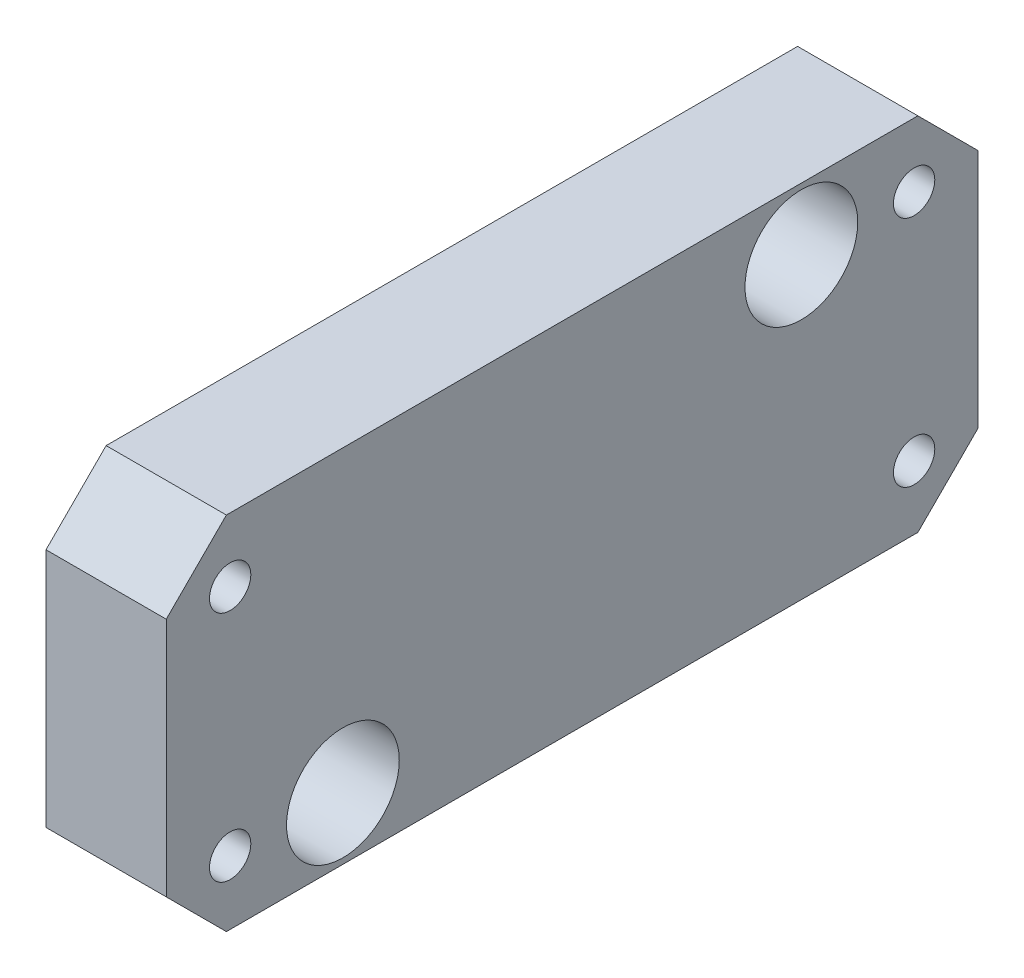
ISO-10303-21;
HEADER;
FILE_DESCRIPTION(('STEP AP214'),'2;1');
FILE_NAME('part.step','',(''),(''),'','','');
FILE_SCHEMA(('AUTOMOTIVE_DESIGN { 1 0 10303 214 1 1 1 1 }'));
ENDSEC;
DATA;
#1=APPLICATION_CONTEXT('core data for automotive mechanical design processes');
#2=APPLICATION_PROTOCOL_DEFINITION('international standard','automotive_design',2000,#1);
#3=PRODUCT_CONTEXT('',#1,'mechanical');
#4=PRODUCT('Part','Part','',(#3));
#5=PRODUCT_RELATED_PRODUCT_CATEGORY('part','',(#4));
#6=PRODUCT_DEFINITION_FORMATION('','',#4);
#7=PRODUCT_DEFINITION_CONTEXT('part definition',#1,'design');
#8=PRODUCT_DEFINITION('design','',#6,#7);
#9=PRODUCT_DEFINITION_SHAPE('','',#8);
#10=(LENGTH_UNIT() NAMED_UNIT(*) SI_UNIT(.MILLI.,.METRE.));
#11=(NAMED_UNIT(*) PLANE_ANGLE_UNIT() SI_UNIT($,.RADIAN.));
#12=(NAMED_UNIT(*) SI_UNIT($,.STERADIAN.) SOLID_ANGLE_UNIT());
#13=UNCERTAINTY_MEASURE_WITH_UNIT(LENGTH_MEASURE(1.E-05),#10,'distance_accuracy_value','');
#14=(GEOMETRIC_REPRESENTATION_CONTEXT(3) GLOBAL_UNCERTAINTY_ASSIGNED_CONTEXT((#13)) GLOBAL_UNIT_ASSIGNED_CONTEXT((#10,
#11,#12)) REPRESENTATION_CONTEXT('',''));
#15=CARTESIAN_POINT('',(0.,0.,0.));
#16=DIRECTION('',(0.,0.,1.));
#17=DIRECTION('',(1.,0.,0.));
#18=AXIS2_PLACEMENT_3D('',#15,#16,#17);
#19=CARTESIAN_POINT('',(-44.,0.,0.));
#20=DIRECTION('',(1.,0.,0.));
#21=DIRECTION('',(0.,0.,-1.));
#22=AXIS2_PLACEMENT_3D('',#19,#20,#21);
#23=PLANE('',#22);
#24=DIRECTION('',(0.,0.707106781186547,0.707106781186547));
#25=VECTOR('',#24,1.);
#26=CARTESIAN_POINT('',(-44.,-24.,46.));
#27=LINE('',#26,#25);
#28=CARTESIAN_POINT('',(-44.,-24.,46.));
#29=VERTEX_POINT('',#28);
#30=CARTESIAN_POINT('',(-44.,-16.,54.));
#31=VERTEX_POINT('',#30);
#32=EDGE_CURVE('E78',#29,#31,#27,.T.);
#33=ORIENTED_EDGE('',*,*,#32,.F.);
#34=DIRECTION('',(0.,0.,1.));
#35=VECTOR('',#34,1.);
#36=CARTESIAN_POINT('',(-44.,-24.,-46.));
#37=LINE('',#36,#35);
#38=CARTESIAN_POINT('',(-44.,-24.,-46.));
#39=VERTEX_POINT('',#38);
#40=EDGE_CURVE('E254',#39,#29,#37,.T.);
#41=ORIENTED_EDGE('',*,*,#40,.F.);
#42=DIRECTION('',(0.,-0.707106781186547,0.707106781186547));
#43=VECTOR('',#42,1.);
#44=CARTESIAN_POINT('',(-44.,-16.,-54.));
#45=LINE('',#44,#43);
#46=CARTESIAN_POINT('',(-44.,-16.,-54.));
#47=VERTEX_POINT('',#46);
#48=EDGE_CURVE('E255',#47,#39,#45,.T.);
#49=ORIENTED_EDGE('',*,*,#48,.F.);
#50=DIRECTION('',(0.,-1.,0.));
#51=VECTOR('',#50,1.);
#52=CARTESIAN_POINT('',(-44.,16.,-54.));
#53=LINE('',#52,#51);
#54=CARTESIAN_POINT('',(-44.,16.,-54.));
#55=VERTEX_POINT('',#54);
#56=EDGE_CURVE('E215',#55,#47,#53,.T.);
#57=ORIENTED_EDGE('',*,*,#56,.F.);
#58=DIRECTION('',(0.,-0.707106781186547,-0.707106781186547));
#59=VECTOR('',#58,1.);
#60=CARTESIAN_POINT('',(-44.,24.,-46.));
#61=LINE('',#60,#59);
#62=CARTESIAN_POINT('',(-44.,24.,-46.));
#63=VERTEX_POINT('',#62);
#64=EDGE_CURVE('E216',#63,#55,#61,.T.);
#65=ORIENTED_EDGE('',*,*,#64,.F.);
#66=DIRECTION('',(0.,0.,-1.));
#67=VECTOR('',#66,1.);
#68=CARTESIAN_POINT('',(-44.,24.,46.));
#69=LINE('',#68,#67);
#70=CARTESIAN_POINT('',(-44.,24.,46.));
#71=VERTEX_POINT('',#70);
#72=EDGE_CURVE('E188',#71,#63,#69,.T.);
#73=ORIENTED_EDGE('',*,*,#72,.F.);
#74=DIRECTION('',(0.,0.707106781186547,-0.707106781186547));
#75=VECTOR('',#74,1.);
#76=CARTESIAN_POINT('',(-44.,16.,54.));
#77=LINE('',#76,#75);
#78=CARTESIAN_POINT('',(-44.,16.,54.));
#79=VERTEX_POINT('',#78);
#80=EDGE_CURVE('E156',#79,#71,#77,.T.);
#81=ORIENTED_EDGE('',*,*,#80,.F.);
#82=DIRECTION('',(0.,1.,0.));
#83=VECTOR('',#82,1.);
#84=CARTESIAN_POINT('',(-44.,-16.,54.));
#85=LINE('',#84,#83);
#86=EDGE_CURVE('E86',#31,#79,#85,.T.);
#87=ORIENTED_EDGE('',*,*,#86,.F.);
#88=EDGE_LOOP('',(#33,#41,#49,#57,#65,#73,#81,#87));
#89=FACE_BOUND('',#88,.T.);
#90=CARTESIAN_POINT('',(-44.,-15.75,30.5));
#91=DIRECTION('',(-1.,0.,0.));
#92=DIRECTION('',(0.,0.,-1.));
#93=AXIS2_PLACEMENT_3D('',#90,#91,#92);
#94=CIRCLE('',#93,7.5);
#95=CARTESIAN_POINT('',(-44.,-15.75,23.));
#96=VERTEX_POINT('',#95);
#97=EDGE_CURVE('E9',#96,#96,#94,.T.);
#98=ORIENTED_EDGE('',*,*,#97,.T.);
#99=EDGE_LOOP('',(#98));
#100=FACE_BOUND('',#99,.T.);
#101=CARTESIAN_POINT('',(-44.,15.75,-30.5));
#102=DIRECTION('',(-1.,0.,0.));
#103=DIRECTION('',(0.,0.,-1.));
#104=AXIS2_PLACEMENT_3D('',#101,#102,#103);
#105=CIRCLE('',#104,7.5);
#106=CARTESIAN_POINT('',(-44.,15.75,-38.));
#107=VERTEX_POINT('',#106);
#108=EDGE_CURVE('E25',#107,#107,#105,.T.);
#109=ORIENTED_EDGE('',*,*,#108,.T.);
#110=EDGE_LOOP('',(#109));
#111=FACE_BOUND('',#110,.T.);
#112=CARTESIAN_POINT('',(-44.,-15.5,45.5));
#113=DIRECTION('',(-1.,0.,0.));
#114=DIRECTION('',(0.,0.,-1.));
#115=AXIS2_PLACEMENT_3D('',#112,#113,#114);
#116=CIRCLE('',#115,2.75);
#117=CARTESIAN_POINT('',(-44.,-15.5,42.75));
#118=VERTEX_POINT('',#117);
#119=EDGE_CURVE('E155',#118,#118,#116,.T.);
#120=ORIENTED_EDGE('',*,*,#119,.T.);
#121=EDGE_LOOP('',(#120));
#122=FACE_BOUND('',#121,.T.);
#123=CARTESIAN_POINT('',(-44.,15.5,45.5));
#124=DIRECTION('',(-1.,0.,0.));
#125=DIRECTION('',(0.,0.,-1.));
#126=AXIS2_PLACEMENT_3D('',#123,#124,#125);
#127=CIRCLE('',#126,2.75);
#128=CARTESIAN_POINT('',(-44.,15.5,42.75));
#129=VERTEX_POINT('',#128);
#130=EDGE_CURVE('E150',#129,#129,#127,.T.);
#131=ORIENTED_EDGE('',*,*,#130,.T.);
#132=EDGE_LOOP('',(#131));
#133=FACE_BOUND('',#132,.T.);
#134=CARTESIAN_POINT('',(-44.,15.5,-45.5));
#135=DIRECTION('',(-1.,0.,0.));
#136=DIRECTION('',(0.,0.,-1.));
#137=AXIS2_PLACEMENT_3D('',#134,#135,#136);
#138=CIRCLE('',#137,2.75);
#139=CARTESIAN_POINT('',(-44.,15.5,-48.25));
#140=VERTEX_POINT('',#139);
#141=EDGE_CURVE('E146',#140,#140,#138,.T.);
#142=ORIENTED_EDGE('',*,*,#141,.T.);
#143=EDGE_LOOP('',(#142));
#144=FACE_BOUND('',#143,.T.);
#145=CARTESIAN_POINT('',(-44.,-15.5,-45.5));
#146=DIRECTION('',(-1.,0.,0.));
#147=DIRECTION('',(0.,0.,-1.));
#148=AXIS2_PLACEMENT_3D('',#145,#146,#147);
#149=CIRCLE('',#148,2.75);
#150=CARTESIAN_POINT('',(-44.,-15.5,-48.25));
#151=VERTEX_POINT('',#150);
#152=EDGE_CURVE('E151',#151,#151,#149,.T.);
#153=ORIENTED_EDGE('',*,*,#152,.T.);
#154=EDGE_LOOP('',(#153));
#155=FACE_BOUND('',#154,.T.);
#156=ADVANCED_FACE('F14',(#89,#100,#111,#122,#133,#144,#155),#23,.T.);
#157=CARTESIAN_POINT('',(-60.0000000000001,0.,0.));
#158=DIRECTION('',(-1.,0.,0.));
#159=DIRECTION('',(0.,0.,1.));
#160=AXIS2_PLACEMENT_3D('',#157,#158,#159);
#161=PLANE('',#160);
#162=DIRECTION('',(0.,0.,1.));
#163=VECTOR('',#162,1.);
#164=CARTESIAN_POINT('',(-60.0000000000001,-24.,-46.));
#165=LINE('',#164,#163);
#166=CARTESIAN_POINT('',(-60.0000000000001,-24.,-46.));
#167=VERTEX_POINT('',#166);
#168=CARTESIAN_POINT('',(-60.0000000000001,-24.,46.));
#169=VERTEX_POINT('',#168);
#170=EDGE_CURVE('E207',#167,#169,#165,.T.);
#171=ORIENTED_EDGE('',*,*,#170,.T.);
#172=DIRECTION('',(0.,0.707106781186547,0.707106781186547));
#173=VECTOR('',#172,1.);
#174=CARTESIAN_POINT('',(-60.0000000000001,-24.,46.));
#175=LINE('',#174,#173);
#176=CARTESIAN_POINT('',(-60.0000000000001,-16.,54.));
#177=VERTEX_POINT('',#176);
#178=EDGE_CURVE('E211',#169,#177,#175,.T.);
#179=ORIENTED_EDGE('',*,*,#178,.T.);
#180=DIRECTION('',(0.,1.,0.));
#181=VECTOR('',#180,1.);
#182=CARTESIAN_POINT('',(-60.0000000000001,-16.,54.));
#183=LINE('',#182,#181);
#184=CARTESIAN_POINT('',(-60.0000000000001,16.,54.));
#185=VERTEX_POINT('',#184);
#186=EDGE_CURVE('E220',#177,#185,#183,.T.);
#187=ORIENTED_EDGE('',*,*,#186,.T.);
#188=DIRECTION('',(0.,0.707106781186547,-0.707106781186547));
#189=VECTOR('',#188,1.);
#190=CARTESIAN_POINT('',(-60.0000000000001,16.,54.));
#191=LINE('',#190,#189);
#192=CARTESIAN_POINT('',(-60.0000000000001,24.,46.));
#193=VERTEX_POINT('',#192);
#194=EDGE_CURVE('E217',#185,#193,#191,.T.);
#195=ORIENTED_EDGE('',*,*,#194,.T.);
#196=DIRECTION('',(0.,0.,-1.));
#197=VECTOR('',#196,1.);
#198=CARTESIAN_POINT('',(-60.0000000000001,24.,46.));
#199=LINE('',#198,#197);
#200=CARTESIAN_POINT('',(-60.0000000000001,24.,-46.));
#201=VERTEX_POINT('',#200);
#202=EDGE_CURVE('E221',#193,#201,#199,.T.);
#203=ORIENTED_EDGE('',*,*,#202,.T.);
#204=DIRECTION('',(0.,-0.707106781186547,-0.707106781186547));
#205=VECTOR('',#204,1.);
#206=CARTESIAN_POINT('',(-60.0000000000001,24.,-46.));
#207=LINE('',#206,#205);
#208=CARTESIAN_POINT('',(-60.0000000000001,16.,-54.));
#209=VERTEX_POINT('',#208);
#210=EDGE_CURVE('E243',#201,#209,#207,.T.);
#211=ORIENTED_EDGE('',*,*,#210,.T.);
#212=DIRECTION('',(0.,-1.,0.));
#213=VECTOR('',#212,1.);
#214=CARTESIAN_POINT('',(-60.0000000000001,16.,-54.));
#215=LINE('',#214,#213);
#216=CARTESIAN_POINT('',(-60.0000000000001,-16.,-54.));
#217=VERTEX_POINT('',#216);
#218=EDGE_CURVE('E258',#209,#217,#215,.T.);
#219=ORIENTED_EDGE('',*,*,#218,.T.);
#220=DIRECTION('',(0.,-0.707106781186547,0.707106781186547));
#221=VECTOR('',#220,1.);
#222=CARTESIAN_POINT('',(-60.0000000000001,-16.,-54.));
#223=LINE('',#222,#221);
#224=EDGE_CURVE('E262',#217,#167,#223,.T.);
#225=ORIENTED_EDGE('',*,*,#224,.T.);
#226=EDGE_LOOP('',(#171,#179,#187,#195,#203,#211,#219,#225));
#227=FACE_BOUND('',#226,.T.);
#228=CARTESIAN_POINT('',(-60.0000000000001,-15.75,30.5));
#229=DIRECTION('',(1.,0.,0.));
#230=DIRECTION('',(0.,0.,-1.));
#231=AXIS2_PLACEMENT_3D('',#228,#229,#230);
#232=CIRCLE('',#231,7.5);
#233=CARTESIAN_POINT('',(-60.0000000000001,-15.75,23.));
#234=VERTEX_POINT('',#233);
#235=EDGE_CURVE('E231',#234,#234,#232,.T.);
#236=ORIENTED_EDGE('',*,*,#235,.T.);
#237=EDGE_LOOP('',(#236));
#238=FACE_BOUND('',#237,.T.);
#239=CARTESIAN_POINT('',(-60.0000000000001,15.75,-30.5));
#240=DIRECTION('',(1.,0.,0.));
#241=DIRECTION('',(0.,0.,-1.));
#242=AXIS2_PLACEMENT_3D('',#239,#240,#241);
#243=CIRCLE('',#242,7.5);
#244=CARTESIAN_POINT('',(-60.0000000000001,15.75,-38.));
#245=VERTEX_POINT('',#244);
#246=EDGE_CURVE('E227',#245,#245,#243,.T.);
#247=ORIENTED_EDGE('',*,*,#246,.T.);
#248=EDGE_LOOP('',(#247));
#249=FACE_BOUND('',#248,.T.);
#250=CARTESIAN_POINT('',(-60.0000000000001,0.,0.));
#251=DIRECTION('',(1.,0.,0.));
#252=DIRECTION('',(0.,0.,-1.));
#253=AXIS2_PLACEMENT_3D('',#250,#251,#252);
#254=CIRCLE('',#253,6.);
#255=CARTESIAN_POINT('',(-60.0000000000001,0.,-6.));
#256=VERTEX_POINT('',#255);
#257=EDGE_CURVE('E232',#256,#256,#254,.T.);
#258=ORIENTED_EDGE('',*,*,#257,.T.);
#259=EDGE_LOOP('',(#258));
#260=FACE_BOUND('',#259,.T.);
#261=CARTESIAN_POINT('',(-60.0000000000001,-15.5,45.5));
#262=DIRECTION('',(1.,0.,0.));
#263=DIRECTION('',(0.,0.,-1.));
#264=AXIS2_PLACEMENT_3D('',#261,#262,#263);
#265=CIRCLE('',#264,5.);
#266=CARTESIAN_POINT('',(-60.0000000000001,-15.5,40.5));
#267=VERTEX_POINT('',#266);
#268=EDGE_CURVE('E276',#267,#267,#265,.T.);
#269=ORIENTED_EDGE('',*,*,#268,.T.);
#270=EDGE_LOOP('',(#269));
#271=FACE_BOUND('',#270,.T.);
#272=CARTESIAN_POINT('',(-60.0000000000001,15.5,45.5));
#273=DIRECTION('',(1.,0.,0.));
#274=DIRECTION('',(0.,0.,-1.));
#275=AXIS2_PLACEMENT_3D('',#272,#273,#274);
#276=CIRCLE('',#275,5.);
#277=CARTESIAN_POINT('',(-60.0000000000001,15.5,40.5));
#278=VERTEX_POINT('',#277);
#279=EDGE_CURVE('E272',#278,#278,#276,.T.);
#280=ORIENTED_EDGE('',*,*,#279,.T.);
#281=EDGE_LOOP('',(#280));
#282=FACE_BOUND('',#281,.T.);
#283=CARTESIAN_POINT('',(-60.0000000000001,15.5,-45.5));
#284=DIRECTION('',(1.,0.,0.));
#285=DIRECTION('',(0.,0.,-1.));
#286=AXIS2_PLACEMENT_3D('',#283,#284,#285);
#287=CIRCLE('',#286,5.);
#288=CARTESIAN_POINT('',(-60.0000000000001,15.5,-50.5));
#289=VERTEX_POINT('',#288);
#290=EDGE_CURVE('E277',#289,#289,#287,.T.);
#291=ORIENTED_EDGE('',*,*,#290,.T.);
#292=EDGE_LOOP('',(#291));
#293=FACE_BOUND('',#292,.T.);
#294=CARTESIAN_POINT('',(-60.0000000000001,-15.5,-45.5));
#295=DIRECTION('',(1.,0.,0.));
#296=DIRECTION('',(0.,0.,-1.));
#297=AXIS2_PLACEMENT_3D('',#294,#295,#296);
#298=CIRCLE('',#297,5.);
#299=CARTESIAN_POINT('',(-60.0000000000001,-15.5,-50.5));
#300=VERTEX_POINT('',#299);
#301=EDGE_CURVE('E280',#300,#300,#298,.T.);
#302=ORIENTED_EDGE('',*,*,#301,.T.);
#303=EDGE_LOOP('',(#302));
#304=FACE_BOUND('',#303,.T.);
#305=ADVANCED_FACE('F373',(#227,#238,#249,#260,#271,#282,#293,#304),#161,.T.);
#306=CARTESIAN_POINT('',(-60.0000000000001,-24.,-46.));
#307=DIRECTION('',(0.,-1.,0.));
#308=DIRECTION('',(0.,0.,-1.));
#309=AXIS2_PLACEMENT_3D('',#306,#307,#308);
#310=PLANE('',#309);
#311=ORIENTED_EDGE('',*,*,#40,.T.);
#312=DIRECTION('',(1.,0.,0.));
#313=VECTOR('',#312,1.);
#314=CARTESIAN_POINT('',(-60.0000000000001,-24.,46.));
#315=LINE('',#314,#313);
#316=EDGE_CURVE('E34',#169,#29,#315,.T.);
#317=ORIENTED_EDGE('',*,*,#316,.F.);
#318=ORIENTED_EDGE('',*,*,#170,.F.);
#319=DIRECTION('',(1.,0.,0.));
#320=VECTOR('',#319,1.);
#321=CARTESIAN_POINT('',(-60.0000000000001,-24.,-46.));
#322=LINE('',#321,#320);
#323=EDGE_CURVE('E250',#167,#39,#322,.T.);
#324=ORIENTED_EDGE('',*,*,#323,.T.);
#325=EDGE_LOOP('',(#311,#317,#318,#324));
#326=FACE_BOUND('',#325,.T.);
#327=ADVANCED_FACE('F378',(#326),#310,.T.);
#328=CARTESIAN_POINT('',(-60.0000000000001,-16.,-54.));
#329=DIRECTION('',(0.,-0.707106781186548,-0.707106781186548));
#330=DIRECTION('',(0.,0.707106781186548,-0.707106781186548));
#331=AXIS2_PLACEMENT_3D('',#328,#329,#330);
#332=PLANE('',#331);
#333=ORIENTED_EDGE('',*,*,#48,.T.);
#334=ORIENTED_EDGE('',*,*,#323,.F.);
#335=ORIENTED_EDGE('',*,*,#224,.F.);
#336=DIRECTION('',(1.,0.,0.));
#337=VECTOR('',#336,1.);
#338=CARTESIAN_POINT('',(-60.0000000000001,-16.,-54.));
#339=LINE('',#338,#337);
#340=EDGE_CURVE('E226',#217,#47,#339,.T.);
#341=ORIENTED_EDGE('',*,*,#340,.T.);
#342=EDGE_LOOP('',(#333,#334,#335,#341));
#343=FACE_BOUND('',#342,.T.);
#344=ADVANCED_FACE('F385',(#343),#332,.T.);
#345=CARTESIAN_POINT('',(-60.0000000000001,16.,-54.));
#346=DIRECTION('',(0.,0.,-1.));
#347=DIRECTION('',(-1.,0.,0.));
#348=AXIS2_PLACEMENT_3D('',#345,#346,#347);
#349=PLANE('',#348);
#350=ORIENTED_EDGE('',*,*,#56,.T.);
#351=ORIENTED_EDGE('',*,*,#340,.F.);
#352=ORIENTED_EDGE('',*,*,#218,.F.);
#353=DIRECTION('',(1.,0.,0.));
#354=VECTOR('',#353,1.);
#355=CARTESIAN_POINT('',(-60.0000000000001,16.,-54.));
#356=LINE('',#355,#354);
#357=EDGE_CURVE('E212',#209,#55,#356,.T.);
#358=ORIENTED_EDGE('',*,*,#357,.T.);
#359=EDGE_LOOP('',(#350,#351,#352,#358));
#360=FACE_BOUND('',#359,.T.);
#361=ADVANCED_FACE('F389',(#360),#349,.T.);
#362=CARTESIAN_POINT('',(-60.0000000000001,24.,-46.));
#363=DIRECTION('',(0.,0.707106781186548,-0.707106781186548));
#364=DIRECTION('',(0.,0.707106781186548,0.707106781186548));
#365=AXIS2_PLACEMENT_3D('',#362,#363,#364);
#366=PLANE('',#365);
#367=ORIENTED_EDGE('',*,*,#64,.T.);
#368=ORIENTED_EDGE('',*,*,#357,.F.);
#369=ORIENTED_EDGE('',*,*,#210,.F.);
#370=DIRECTION('',(1.,0.,0.));
#371=VECTOR('',#370,1.);
#372=CARTESIAN_POINT('',(-60.0000000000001,24.,-46.));
#373=LINE('',#372,#371);
#374=EDGE_CURVE('E239',#201,#63,#373,.T.);
#375=ORIENTED_EDGE('',*,*,#374,.T.);
#376=EDGE_LOOP('',(#367,#368,#369,#375));
#377=FACE_BOUND('',#376,.T.);
#378=ADVANCED_FACE('F393',(#377),#366,.T.);
#379=CARTESIAN_POINT('',(-60.0000000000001,24.,46.));
#380=DIRECTION('',(0.,1.,0.));
#381=DIRECTION('',(0.,0.,1.));
#382=AXIS2_PLACEMENT_3D('',#379,#380,#381);
#383=PLANE('',#382);
#384=ORIENTED_EDGE('',*,*,#72,.T.);
#385=ORIENTED_EDGE('',*,*,#374,.F.);
#386=ORIENTED_EDGE('',*,*,#202,.F.);
#387=DIRECTION('',(1.,0.,0.));
#388=VECTOR('',#387,1.);
#389=CARTESIAN_POINT('',(-60.0000000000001,24.,46.));
#390=LINE('',#389,#388);
#391=EDGE_CURVE('E159',#193,#71,#390,.T.);
#392=ORIENTED_EDGE('',*,*,#391,.T.);
#393=EDGE_LOOP('',(#384,#385,#386,#392));
#394=FACE_BOUND('',#393,.T.);
#395=ADVANCED_FACE('F397',(#394),#383,.T.);
#396=CARTESIAN_POINT('',(-60.0000000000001,16.,54.));
#397=DIRECTION('',(0.,0.707106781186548,0.707106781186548));
#398=DIRECTION('',(0.,-0.707106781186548,0.707106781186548));
#399=AXIS2_PLACEMENT_3D('',#396,#397,#398);
#400=PLANE('',#399);
#401=ORIENTED_EDGE('',*,*,#80,.T.);
#402=ORIENTED_EDGE('',*,*,#391,.F.);
#403=ORIENTED_EDGE('',*,*,#194,.F.);
#404=DIRECTION('',(1.,0.,0.));
#405=VECTOR('',#404,1.);
#406=CARTESIAN_POINT('',(-60.0000000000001,16.,54.));
#407=LINE('',#406,#405);
#408=EDGE_CURVE('E160',#185,#79,#407,.T.);
#409=ORIENTED_EDGE('',*,*,#408,.T.);
#410=EDGE_LOOP('',(#401,#402,#403,#409));
#411=FACE_BOUND('',#410,.T.);
#412=ADVANCED_FACE('F401',(#411),#400,.T.);
#413=CARTESIAN_POINT('',(-60.0000000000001,-16.,54.));
#414=DIRECTION('',(0.,0.,1.));
#415=DIRECTION('',(1.,0.,0.));
#416=AXIS2_PLACEMENT_3D('',#413,#414,#415);
#417=PLANE('',#416);
#418=ORIENTED_EDGE('',*,*,#86,.T.);
#419=ORIENTED_EDGE('',*,*,#408,.F.);
#420=ORIENTED_EDGE('',*,*,#186,.F.);
#421=DIRECTION('',(1.,0.,0.));
#422=VECTOR('',#421,1.);
#423=CARTESIAN_POINT('',(-60.0000000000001,-16.,54.));
#424=LINE('',#423,#422);
#425=EDGE_CURVE('E286',#177,#31,#424,.T.);
#426=ORIENTED_EDGE('',*,*,#425,.T.);
#427=EDGE_LOOP('',(#418,#419,#420,#426));
#428=FACE_BOUND('',#427,.T.);
#429=ADVANCED_FACE('F405',(#428),#417,.T.);
#430=CARTESIAN_POINT('',(-60.0000000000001,-24.,46.));
#431=DIRECTION('',(0.,-0.707106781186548,0.707106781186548));
#432=DIRECTION('',(0.,-0.707106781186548,-0.707106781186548));
#433=AXIS2_PLACEMENT_3D('',#430,#431,#432);
#434=PLANE('',#433);
#435=ORIENTED_EDGE('',*,*,#32,.T.);
#436=ORIENTED_EDGE('',*,*,#425,.F.);
#437=ORIENTED_EDGE('',*,*,#178,.F.);
#438=ORIENTED_EDGE('',*,*,#316,.T.);
#439=EDGE_LOOP('',(#435,#436,#437,#438));
#440=FACE_BOUND('',#439,.T.);
#441=ADVANCED_FACE('F409',(#440),#434,.T.);
#442=CARTESIAN_POINT('',(-52.,-15.75,30.5));
#443=DIRECTION('',(-1.,0.,0.));
#444=DIRECTION('',(0.,0.,1.));
#445=AXIS2_PLACEMENT_3D('',#442,#443,#444);
#446=CYLINDRICAL_SURFACE('',#445,7.5);
#447=ORIENTED_EDGE('',*,*,#97,.F.);
#448=EDGE_LOOP('',(#447));
#449=FACE_BOUND('',#448,.T.);
#450=ORIENTED_EDGE('',*,*,#235,.F.);
#451=EDGE_LOOP('',(#450));
#452=FACE_BOUND('',#451,.T.);
#453=ADVANCED_FACE('F412',(#449,#452),#446,.F.);
#454=CARTESIAN_POINT('',(-52.,15.75,-30.5));
#455=DIRECTION('',(-1.,0.,0.));
#456=DIRECTION('',(0.,0.,1.));
#457=AXIS2_PLACEMENT_3D('',#454,#455,#456);
#458=CYLINDRICAL_SURFACE('',#457,7.5);
#459=ORIENTED_EDGE('',*,*,#108,.F.);
#460=EDGE_LOOP('',(#459));
#461=FACE_BOUND('',#460,.T.);
#462=ORIENTED_EDGE('',*,*,#246,.F.);
#463=EDGE_LOOP('',(#462));
#464=FACE_BOUND('',#463,.T.);
#465=ADVANCED_FACE('F417',(#461,#464),#458,.F.);
#466=CARTESIAN_POINT('',(-46.,0.,0.));
#467=DIRECTION('',(-1.,0.,0.));
#468=DIRECTION('',(0.,0.,1.));
#469=AXIS2_PLACEMENT_3D('',#466,#467,#468);
#470=PLANE('',#469);
#471=CARTESIAN_POINT('',(-46.,0.,0.));
#472=DIRECTION('',(1.,0.,0.));
#473=DIRECTION('',(0.,0.,-1.));
#474=AXIS2_PLACEMENT_3D('',#471,#472,#473);
#475=CIRCLE('',#474,3.375);
#476=CARTESIAN_POINT('',(-46.,0.,-3.375));
#477=VERTEX_POINT('',#476);
#478=EDGE_CURVE('E189',#477,#477,#475,.T.);
#479=ORIENTED_EDGE('',*,*,#478,.F.);
#480=EDGE_LOOP('',(#479));
#481=FACE_BOUND('',#480,.T.);
#482=ADVANCED_FACE('F413',(#481),#470,.T.);
#483=CARTESIAN_POINT('',(-52.9999999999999,0.,0.));
#484=DIRECTION('',(-1.,0.,0.));
#485=DIRECTION('',(0.,0.,1.));
#486=AXIS2_PLACEMENT_3D('',#483,#484,#485);
#487=CYLINDRICAL_SURFACE('',#486,3.375);
#488=ORIENTED_EDGE('',*,*,#478,.T.);
#489=EDGE_LOOP('',(#488));
#490=FACE_BOUND('',#489,.T.);
#491=CARTESIAN_POINT('',(-58.,0.,0.));
#492=DIRECTION('',(-1.,0.,0.));
#493=DIRECTION('',(0.,0.,-1.));
#494=AXIS2_PLACEMENT_3D('',#491,#492,#493);
#495=CIRCLE('',#494,3.375);
#496=CARTESIAN_POINT('',(-58.,0.,-3.375));
#497=VERTEX_POINT('',#496);
#498=EDGE_CURVE('E193',#497,#497,#495,.T.);
#499=ORIENTED_EDGE('',*,*,#498,.T.);
#500=EDGE_LOOP('',(#499));
#501=FACE_BOUND('',#500,.T.);
#502=ADVANCED_FACE('F416',(#490,#501),#487,.F.);
#503=CARTESIAN_POINT('',(-52.9999999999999,0.,-3.975));
#504=DIRECTION('',(0.,-1.,0.));
#505=DIRECTION('',(0.,0.,-1.));
#506=AXIS2_PLACEMENT_3D('',#503,#504,#505);
#507=PLANE('',#506);
#508=DIRECTION('',(0.,0.,-1.));
#509=VECTOR('',#508,1.);
#510=CARTESIAN_POINT('',(-58.,0.,-1.9875));
#511=LINE('',#510,#509);
#512=CARTESIAN_POINT('',(-58.,0.,-3.95));
#513=VERTEX_POINT('',#512);
#514=CARTESIAN_POINT('',(-58.,0.,-4.));
#515=VERTEX_POINT('',#514);
#516=EDGE_CURVE('E194',#513,#515,#511,.T.);
#517=ORIENTED_EDGE('',*,*,#516,.T.);
#518=DIRECTION('',(1.,0.,0.));
#519=VECTOR('',#518,1.);
#520=CARTESIAN_POINT('',(-46.,0.,-4.));
#521=LINE('',#520,#519);
#522=CARTESIAN_POINT('',(-46.,0.,-4.));
#523=VERTEX_POINT('',#522);
#524=EDGE_CURVE('E18',#515,#523,#521,.T.);
#525=ORIENTED_EDGE('',*,*,#524,.T.);
#526=DIRECTION('',(0.,0.,1.));
#527=VECTOR('',#526,1.);
#528=CARTESIAN_POINT('',(-46.,0.,-3.95));
#529=LINE('',#528,#527);
#530=CARTESIAN_POINT('',(-46.,0.,-3.95));
#531=VERTEX_POINT('',#530);
#532=EDGE_CURVE('E202',#523,#531,#529,.T.);
#533=ORIENTED_EDGE('',*,*,#532,.T.);
#534=DIRECTION('',(-1.,0.,0.));
#535=VECTOR('',#534,1.);
#536=CARTESIAN_POINT('',(-60.0000000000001,0.,-3.95));
#537=LINE('',#536,#535);
#538=EDGE_CURVE('E198',#531,#513,#537,.T.);
#539=ORIENTED_EDGE('',*,*,#538,.T.);
#540=EDGE_LOOP('',(#517,#525,#533,#539));
#541=FACE_BOUND('',#540,.T.);
#542=ADVANCED_FACE('F419',(#541),#507,.T.);
#543=CARTESIAN_POINT('',(-52.9999999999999,0.,0.));
#544=DIRECTION('',(-1.,0.,0.));
#545=DIRECTION('',(0.,0.,1.));
#546=AXIS2_PLACEMENT_3D('',#543,#544,#545);
#547=CYLINDRICAL_SURFACE('',#546,3.95);
#548=CARTESIAN_POINT('',(-58.,0.,0.));
#549=DIRECTION('',(1.,0.,0.));
#550=DIRECTION('',(0.,1.,0.));
#551=AXIS2_PLACEMENT_3D('',#548,#549,#550);
#552=CIRCLE('',#551,3.95);
#553=CARTESIAN_POINT('',(-58.,3.95,0.));
#554=VERTEX_POINT('',#553);
#555=EDGE_CURVE('E131',#554,#513,#552,.T.);
#556=ORIENTED_EDGE('',*,*,#555,.T.);
#557=ORIENTED_EDGE('',*,*,#538,.F.);
#558=CARTESIAN_POINT('',(-46.,0.,0.));
#559=DIRECTION('',(1.,0.,0.));
#560=DIRECTION('',(0.,1.,0.));
#561=AXIS2_PLACEMENT_3D('',#558,#559,#560);
#562=CIRCLE('',#561,3.95);
#563=CARTESIAN_POINT('',(-46.,3.95,0.));
#564=VERTEX_POINT('',#563);
#565=EDGE_CURVE('E134',#564,#531,#562,.T.);
#566=ORIENTED_EDGE('',*,*,#565,.F.);
#567=DIRECTION('',(1.,0.,0.));
#568=VECTOR('',#567,1.);
#569=CARTESIAN_POINT('',(-60.0000000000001,3.95,0.));
#570=LINE('',#569,#568);
#571=EDGE_CURVE('E135',#554,#564,#570,.T.);
#572=ORIENTED_EDGE('',*,*,#571,.F.);
#573=EDGE_LOOP('',(#556,#557,#566,#572));
#574=FACE_BOUND('',#573,.T.);
#575=ADVANCED_FACE('F422',(#574),#547,.T.);
#576=CARTESIAN_POINT('',(-46.,3.975,0.));
#577=DIRECTION('',(-1.,0.,0.));
#578=DIRECTION('',(0.,0.,1.));
#579=AXIS2_PLACEMENT_3D('',#576,#577,#578);
#580=PLANE('',#579);
#581=ORIENTED_EDGE('',*,*,#532,.F.);
#582=CARTESIAN_POINT('',(-46.,0.,0.));
#583=DIRECTION('',(1.,0.,0.));
#584=DIRECTION('',(0.,1.,0.));
#585=AXIS2_PLACEMENT_3D('',#582,#583,#584);
#586=CIRCLE('',#585,4.);
#587=CARTESIAN_POINT('',(-46.,4.,0.));
#588=VERTEX_POINT('',#587);
#589=EDGE_CURVE('E184',#588,#523,#586,.T.);
#590=ORIENTED_EDGE('',*,*,#589,.F.);
#591=DIRECTION('',(0.,1.,0.));
#592=VECTOR('',#591,1.);
#593=CARTESIAN_POINT('',(-46.,3.95,0.));
#594=LINE('',#593,#592);
#595=EDGE_CURVE('E126',#564,#588,#594,.T.);
#596=ORIENTED_EDGE('',*,*,#595,.F.);
#597=ORIENTED_EDGE('',*,*,#565,.T.);
#598=EDGE_LOOP('',(#581,#590,#596,#597));
#599=FACE_BOUND('',#598,.T.);
#600=ADVANCED_FACE('F426',(#599),#580,.T.);
#601=CARTESIAN_POINT('',(-52.9999999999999,3.975,0.));
#602=DIRECTION('',(0.,0.,1.));
#603=DIRECTION('',(1.,0.,0.));
#604=AXIS2_PLACEMENT_3D('',#601,#602,#603);
#605=PLANE('',#604);
#606=DIRECTION('',(0.,-1.,0.));
#607=VECTOR('',#606,1.);
#608=CARTESIAN_POINT('',(-58.,1.9875,0.));
#609=LINE('',#608,#607);
#610=CARTESIAN_POINT('',(-58.,4.,0.));
#611=VERTEX_POINT('',#610);
#612=EDGE_CURVE('E123',#611,#554,#609,.T.);
#613=ORIENTED_EDGE('',*,*,#612,.T.);
#614=ORIENTED_EDGE('',*,*,#571,.T.);
#615=ORIENTED_EDGE('',*,*,#595,.T.);
#616=DIRECTION('',(-1.,0.,0.));
#617=VECTOR('',#616,1.);
#618=CARTESIAN_POINT('',(-46.,4.,0.));
#619=LINE('',#618,#617);
#620=EDGE_CURVE('E111',#588,#611,#619,.T.);
#621=ORIENTED_EDGE('',*,*,#620,.T.);
#622=EDGE_LOOP('',(#613,#614,#615,#621));
#623=FACE_BOUND('',#622,.T.);
#624=ADVANCED_FACE('F122',(#623),#605,.T.);
#625=CARTESIAN_POINT('',(-52.9999999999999,0.,0.));
#626=DIRECTION('',(-1.,0.,0.));
#627=DIRECTION('',(0.,0.,1.));
#628=AXIS2_PLACEMENT_3D('',#625,#626,#627);
#629=CYLINDRICAL_SURFACE('',#628,4.);
#630=CARTESIAN_POINT('',(-58.,0.,0.));
#631=DIRECTION('',(-1.,0.,0.));
#632=DIRECTION('',(0.,1.,0.));
#633=AXIS2_PLACEMENT_3D('',#630,#631,#632);
#634=CIRCLE('',#633,4.);
#635=EDGE_CURVE('E108',#515,#611,#634,.T.);
#636=ORIENTED_EDGE('',*,*,#635,.T.);
#637=ORIENTED_EDGE('',*,*,#620,.F.);
#638=ORIENTED_EDGE('',*,*,#589,.T.);
#639=ORIENTED_EDGE('',*,*,#524,.F.);
#640=EDGE_LOOP('',(#636,#637,#638,#639));
#641=FACE_BOUND('',#640,.T.);
#642=ADVANCED_FACE('F110',(#641),#629,.F.);
#643=CARTESIAN_POINT('',(-58.9999999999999,0.,0.));
#644=DIRECTION('',(-1.,0.,0.));
#645=DIRECTION('',(0.,0.,1.));
#646=AXIS2_PLACEMENT_3D('',#643,#644,#645);
#647=CYLINDRICAL_SURFACE('',#646,6.);
#648=CARTESIAN_POINT('',(-58.,0.,0.));
#649=DIRECTION('',(1.,0.,0.));
#650=DIRECTION('',(0.,0.,-1.));
#651=AXIS2_PLACEMENT_3D('',#648,#649,#650);
#652=CIRCLE('',#651,6.);
#653=CARTESIAN_POINT('',(-58.,0.,-6.));
#654=VERTEX_POINT('',#653);
#655=EDGE_CURVE('E119',#654,#654,#652,.T.);
#656=ORIENTED_EDGE('',*,*,#655,.T.);
#657=EDGE_LOOP('',(#656));
#658=FACE_BOUND('',#657,.T.);
#659=ORIENTED_EDGE('',*,*,#257,.F.);
#660=EDGE_LOOP('',(#659));
#661=FACE_BOUND('',#660,.T.);
#662=ADVANCED_FACE('F434',(#658,#661),#647,.F.);
#663=CARTESIAN_POINT('',(-58.,0.,0.));
#664=DIRECTION('',(-1.,0.,0.));
#665=DIRECTION('',(0.,0.,1.));
#666=AXIS2_PLACEMENT_3D('',#663,#664,#665);
#667=PLANE('',#666);
#668=ORIENTED_EDGE('',*,*,#555,.F.);
#669=ORIENTED_EDGE('',*,*,#612,.F.);
#670=ORIENTED_EDGE('',*,*,#635,.F.);
#671=ORIENTED_EDGE('',*,*,#516,.F.);
#672=EDGE_LOOP('',(#668,#669,#670,#671));
#673=FACE_BOUND('',#672,.T.);
#674=ORIENTED_EDGE('',*,*,#498,.F.);
#675=EDGE_LOOP('',(#674));
#676=FACE_BOUND('',#675,.T.);
#677=ORIENTED_EDGE('',*,*,#655,.F.);
#678=EDGE_LOOP('',(#677));
#679=FACE_BOUND('',#678,.T.);
#680=ADVANCED_FACE('F129',(#673,#676,#679),#667,.T.);
#681=CARTESIAN_POINT('',(-52.,-15.5,45.5));
#682=DIRECTION('',(-1.,0.,0.));
#683=DIRECTION('',(0.,0.,1.));
#684=AXIS2_PLACEMENT_3D('',#681,#682,#683);
#685=CYLINDRICAL_SURFACE('',#684,2.75);
#686=ORIENTED_EDGE('',*,*,#119,.F.);
#687=EDGE_LOOP('',(#686));
#688=FACE_BOUND('',#687,.T.);
#689=CARTESIAN_POINT('',(-52.7,-15.5,45.5));
#690=DIRECTION('',(-1.,0.,0.));
#691=DIRECTION('',(0.,0.,-1.));
#692=AXIS2_PLACEMENT_3D('',#689,#690,#691);
#693=CIRCLE('',#692,2.75);
#694=CARTESIAN_POINT('',(-52.7,-15.5,42.75));
#695=VERTEX_POINT('',#694);
#696=EDGE_CURVE('E161',#695,#695,#693,.T.);
#697=ORIENTED_EDGE('',*,*,#696,.T.);
#698=EDGE_LOOP('',(#697));
#699=FACE_BOUND('',#698,.T.);
#700=ADVANCED_FACE('F349',(#688,#699),#685,.F.);
#701=CARTESIAN_POINT('',(-52.,15.5,45.5));
#702=DIRECTION('',(-1.,0.,0.));
#703=DIRECTION('',(0.,0.,1.));
#704=AXIS2_PLACEMENT_3D('',#701,#702,#703);
#705=CYLINDRICAL_SURFACE('',#704,2.75);
#706=ORIENTED_EDGE('',*,*,#130,.F.);
#707=EDGE_LOOP('',(#706));
#708=FACE_BOUND('',#707,.T.);
#709=CARTESIAN_POINT('',(-52.7,15.5,45.5));
#710=DIRECTION('',(-1.,0.,0.));
#711=DIRECTION('',(0.,0.,-1.));
#712=AXIS2_PLACEMENT_3D('',#709,#710,#711);
#713=CIRCLE('',#712,2.75);
#714=CARTESIAN_POINT('',(-52.7,15.5,42.75));
#715=VERTEX_POINT('',#714);
#716=EDGE_CURVE('E179',#715,#715,#713,.T.);
#717=ORIENTED_EDGE('',*,*,#716,.T.);
#718=EDGE_LOOP('',(#717));
#719=FACE_BOUND('',#718,.T.);
#720=ADVANCED_FACE('F345',(#708,#719),#705,.F.);
#721=CARTESIAN_POINT('',(-52.,15.5,-45.5));
#722=DIRECTION('',(-1.,0.,0.));
#723=DIRECTION('',(0.,0.,1.));
#724=AXIS2_PLACEMENT_3D('',#721,#722,#723);
#725=CYLINDRICAL_SURFACE('',#724,2.75);
#726=ORIENTED_EDGE('',*,*,#141,.F.);
#727=EDGE_LOOP('',(#726));
#728=FACE_BOUND('',#727,.T.);
#729=CARTESIAN_POINT('',(-52.7,15.5,-45.5));
#730=DIRECTION('',(-1.,0.,0.));
#731=DIRECTION('',(0.,0.,-1.));
#732=AXIS2_PLACEMENT_3D('',#729,#730,#731);
#733=CIRCLE('',#732,2.75);
#734=CARTESIAN_POINT('',(-52.7,15.5,-48.25));
#735=VERTEX_POINT('',#734);
#736=EDGE_CURVE('E183',#735,#735,#733,.T.);
#737=ORIENTED_EDGE('',*,*,#736,.T.);
#738=EDGE_LOOP('',(#737));
#739=FACE_BOUND('',#738,.T.);
#740=ADVANCED_FACE('F348',(#728,#739),#725,.F.);
#741=CARTESIAN_POINT('',(-52.,-15.5,-45.5));
#742=DIRECTION('',(-1.,0.,0.));
#743=DIRECTION('',(0.,0.,1.));
#744=AXIS2_PLACEMENT_3D('',#741,#742,#743);
#745=CYLINDRICAL_SURFACE('',#744,2.75);
#746=ORIENTED_EDGE('',*,*,#152,.F.);
#747=EDGE_LOOP('',(#746));
#748=FACE_BOUND('',#747,.T.);
#749=CARTESIAN_POINT('',(-52.7,-15.5,-45.5));
#750=DIRECTION('',(-1.,0.,0.));
#751=DIRECTION('',(0.,0.,-1.));
#752=AXIS2_PLACEMENT_3D('',#749,#750,#751);
#753=CIRCLE('',#752,2.75);
#754=CARTESIAN_POINT('',(-52.7,-15.5,-48.25));
#755=VERTEX_POINT('',#754);
#756=EDGE_CURVE('E165',#755,#755,#753,.T.);
#757=ORIENTED_EDGE('',*,*,#756,.T.);
#758=EDGE_LOOP('',(#757));
#759=FACE_BOUND('',#758,.T.);
#760=ADVANCED_FACE('F436',(#748,#759),#745,.F.);
#761=CARTESIAN_POINT('',(-52.7,-15.5,45.5));
#762=DIRECTION('',(-1.,0.,0.));
#763=DIRECTION('',(0.,0.,1.));
#764=AXIS2_PLACEMENT_3D('',#761,#762,#763);
#765=PLANE('',#764);
#766=CARTESIAN_POINT('',(-52.7,-15.5,45.5));
#767=DIRECTION('',(1.,0.,0.));
#768=DIRECTION('',(0.,0.,-1.));
#769=AXIS2_PLACEMENT_3D('',#766,#767,#768);
#770=CIRCLE('',#769,5.);
#771=CARTESIAN_POINT('',(-52.7,-15.5,40.5));
#772=VERTEX_POINT('',#771);
#773=EDGE_CURVE('E178',#772,#772,#770,.T.);
#774=ORIENTED_EDGE('',*,*,#773,.F.);
#775=EDGE_LOOP('',(#774));
#776=FACE_BOUND('',#775,.T.);
#777=ORIENTED_EDGE('',*,*,#696,.F.);
#778=EDGE_LOOP('',(#777));
#779=FACE_BOUND('',#778,.T.);
#780=ADVANCED_FACE('F366',(#776,#779),#765,.T.);
#781=CARTESIAN_POINT('',(-56.35,-15.5,45.5));
#782=DIRECTION('',(-1.,0.,0.));
#783=DIRECTION('',(0.,0.,1.));
#784=AXIS2_PLACEMENT_3D('',#781,#782,#783);
#785=CYLINDRICAL_SURFACE('',#784,5.);
#786=ORIENTED_EDGE('',*,*,#773,.T.);
#787=EDGE_LOOP('',(#786));
#788=FACE_BOUND('',#787,.T.);
#789=ORIENTED_EDGE('',*,*,#268,.F.);
#790=EDGE_LOOP('',(#789));
#791=FACE_BOUND('',#790,.T.);
#792=ADVANCED_FACE('F356',(#788,#791),#785,.F.);
#793=CARTESIAN_POINT('',(-52.7,15.5,45.5));
#794=DIRECTION('',(-1.,0.,0.));
#795=DIRECTION('',(0.,0.,1.));
#796=AXIS2_PLACEMENT_3D('',#793,#794,#795);
#797=PLANE('',#796);
#798=CARTESIAN_POINT('',(-52.7,15.5,45.5));
#799=DIRECTION('',(1.,0.,0.));
#800=DIRECTION('',(0.,0.,-1.));
#801=AXIS2_PLACEMENT_3D('',#798,#799,#800);
#802=CIRCLE('',#801,5.);
#803=CARTESIAN_POINT('',(-52.7,15.5,40.5));
#804=VERTEX_POINT('',#803);
#805=EDGE_CURVE('E174',#804,#804,#802,.T.);
#806=ORIENTED_EDGE('',*,*,#805,.F.);
#807=EDGE_LOOP('',(#806));
#808=FACE_BOUND('',#807,.T.);
#809=ORIENTED_EDGE('',*,*,#716,.F.);
#810=EDGE_LOOP('',(#809));
#811=FACE_BOUND('',#810,.T.);
#812=ADVANCED_FACE('F353',(#808,#811),#797,.T.);
#813=CARTESIAN_POINT('',(-56.35,15.5,45.5));
#814=DIRECTION('',(-1.,0.,0.));
#815=DIRECTION('',(0.,0.,1.));
#816=AXIS2_PLACEMENT_3D('',#813,#814,#815);
#817=CYLINDRICAL_SURFACE('',#816,5.);
#818=ORIENTED_EDGE('',*,*,#805,.T.);
#819=EDGE_LOOP('',(#818));
#820=FACE_BOUND('',#819,.T.);
#821=ORIENTED_EDGE('',*,*,#279,.F.);
#822=EDGE_LOOP('',(#821));
#823=FACE_BOUND('',#822,.T.);
#824=ADVANCED_FACE('F355',(#820,#823),#817,.F.);
#825=CARTESIAN_POINT('',(-52.7,15.5,-45.5));
#826=DIRECTION('',(-1.,0.,0.));
#827=DIRECTION('',(0.,0.,1.));
#828=AXIS2_PLACEMENT_3D('',#825,#826,#827);
#829=PLANE('',#828);
#830=CARTESIAN_POINT('',(-52.7,15.5,-45.5));
#831=DIRECTION('',(1.,0.,0.));
#832=DIRECTION('',(0.,0.,-1.));
#833=AXIS2_PLACEMENT_3D('',#830,#831,#832);
#834=CIRCLE('',#833,5.);
#835=CARTESIAN_POINT('',(-52.7,15.5,-50.5));
#836=VERTEX_POINT('',#835);
#837=EDGE_CURVE('E166',#836,#836,#834,.T.);
#838=ORIENTED_EDGE('',*,*,#837,.F.);
#839=EDGE_LOOP('',(#838));
#840=FACE_BOUND('',#839,.T.);
#841=ORIENTED_EDGE('',*,*,#736,.F.);
#842=EDGE_LOOP('',(#841));
#843=FACE_BOUND('',#842,.T.);
#844=ADVANCED_FACE('F363',(#840,#843),#829,.T.);
#845=CARTESIAN_POINT('',(-56.35,15.5,-45.5));
#846=DIRECTION('',(-1.,0.,0.));
#847=DIRECTION('',(0.,0.,1.));
#848=AXIS2_PLACEMENT_3D('',#845,#846,#847);
#849=CYLINDRICAL_SURFACE('',#848,5.);
#850=ORIENTED_EDGE('',*,*,#837,.T.);
#851=EDGE_LOOP('',(#850));
#852=FACE_BOUND('',#851,.T.);
#853=ORIENTED_EDGE('',*,*,#290,.F.);
#854=EDGE_LOOP('',(#853));
#855=FACE_BOUND('',#854,.T.);
#856=ADVANCED_FACE('F456',(#852,#855),#849,.F.);
#857=CARTESIAN_POINT('',(-52.7,-15.5,-45.5));
#858=DIRECTION('',(-1.,0.,0.));
#859=DIRECTION('',(0.,0.,1.));
#860=AXIS2_PLACEMENT_3D('',#857,#858,#859);
#861=PLANE('',#860);
#862=CARTESIAN_POINT('',(-52.7,-15.5,-45.5));
#863=DIRECTION('',(1.,0.,0.));
#864=DIRECTION('',(0.,0.,-1.));
#865=AXIS2_PLACEMENT_3D('',#862,#863,#864);
#866=CIRCLE('',#865,5.);
#867=CARTESIAN_POINT('',(-52.7,-15.5,-50.5));
#868=VERTEX_POINT('',#867);
#869=EDGE_CURVE('E170',#868,#868,#866,.T.);
#870=ORIENTED_EDGE('',*,*,#869,.F.);
#871=EDGE_LOOP('',(#870));
#872=FACE_BOUND('',#871,.T.);
#873=ORIENTED_EDGE('',*,*,#756,.F.);
#874=EDGE_LOOP('',(#873));
#875=FACE_BOUND('',#874,.T.);
#876=ADVANCED_FACE('F458',(#872,#875),#861,.T.);
#877=CARTESIAN_POINT('',(-56.35,-15.5,-45.5));
#878=DIRECTION('',(-1.,0.,0.));
#879=DIRECTION('',(0.,0.,1.));
#880=AXIS2_PLACEMENT_3D('',#877,#878,#879);
#881=CYLINDRICAL_SURFACE('',#880,5.);
#882=ORIENTED_EDGE('',*,*,#869,.T.);
#883=EDGE_LOOP('',(#882));
#884=FACE_BOUND('',#883,.T.);
#885=ORIENTED_EDGE('',*,*,#301,.F.);
#886=EDGE_LOOP('',(#885));
#887=FACE_BOUND('',#886,.T.);
#888=ADVANCED_FACE('F16',(#884,#887),#881,.F.);
#889=CLOSED_SHELL('',(#156,#305,#327,#344,#361,#378,#395,#412,#429,#441,#453,#465,#482,#502,
#542,#575,#600,#624,#642,#662,#680,#700,#720,#740,#760,#780,#792,#812,#824,#844,#856,#876,#888));
#890=MANIFOLD_SOLID_BREP('B1',#889);
#891=ADVANCED_BREP_SHAPE_REPRESENTATION('',(#18,#890),#14);
#892=SHAPE_DEFINITION_REPRESENTATION(#9,#891);
ENDSEC;
END-ISO-10303-21;
